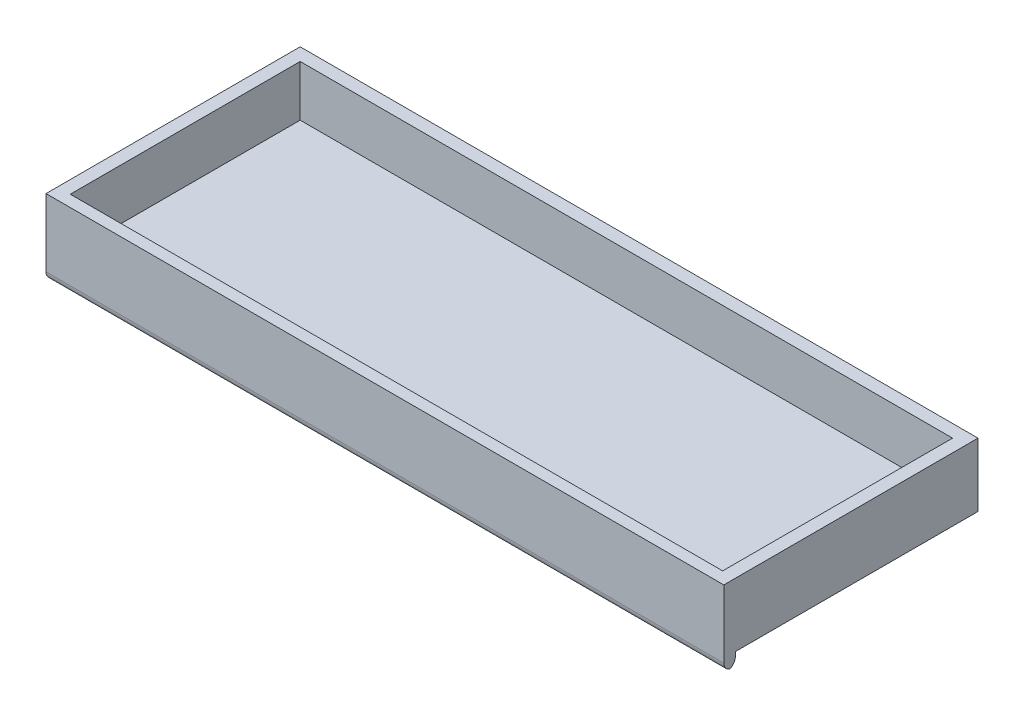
ISO-10303-21;
HEADER;
FILE_DESCRIPTION(('STEP AP214'),'2;1');
FILE_NAME('part.step','',(''),(''),'','','');
FILE_SCHEMA(('AUTOMOTIVE_DESIGN { 1 0 10303 214 1 1 1 1 }'));
ENDSEC;
DATA;
#1=APPLICATION_CONTEXT('core data for automotive mechanical design processes');
#2=APPLICATION_PROTOCOL_DEFINITION('international standard','automotive_design',2000,#1);
#3=PRODUCT_CONTEXT('',#1,'mechanical');
#4=PRODUCT('Part','Part','',(#3));
#5=PRODUCT_RELATED_PRODUCT_CATEGORY('part','',(#4));
#6=PRODUCT_DEFINITION_FORMATION('','',#4);
#7=PRODUCT_DEFINITION_CONTEXT('part definition',#1,'design');
#8=PRODUCT_DEFINITION('design','',#6,#7);
#9=PRODUCT_DEFINITION_SHAPE('','',#8);
#10=(LENGTH_UNIT() NAMED_UNIT(*) SI_UNIT(.MILLI.,.METRE.));
#11=(NAMED_UNIT(*) PLANE_ANGLE_UNIT() SI_UNIT($,.RADIAN.));
#12=(NAMED_UNIT(*) SI_UNIT($,.STERADIAN.) SOLID_ANGLE_UNIT());
#13=UNCERTAINTY_MEASURE_WITH_UNIT(LENGTH_MEASURE(1.E-05),#10,'distance_accuracy_value','');
#14=(GEOMETRIC_REPRESENTATION_CONTEXT(3) GLOBAL_UNCERTAINTY_ASSIGNED_CONTEXT((#13)) GLOBAL_UNIT_ASSIGNED_CONTEXT((#10,
#11,#12)) REPRESENTATION_CONTEXT('',''));
#15=CARTESIAN_POINT('',(0.,0.,0.));
#16=DIRECTION('',(0.,0.,1.));
#17=DIRECTION('',(1.,0.,0.));
#18=AXIS2_PLACEMENT_3D('',#15,#16,#17);
#19=CARTESIAN_POINT('',(0.,0.,0.));
#20=DIRECTION('',(0.,-1.,0.));
#21=DIRECTION('',(0.,0.,-1.));
#22=AXIS2_PLACEMENT_3D('',#19,#20,#21);
#23=PLANE('',#22);
#24=DIRECTION('',(0.,0.,-1.));
#25=VECTOR('',#24,1.);
#26=CARTESIAN_POINT('',(203.2,0.,76.2));
#27=LINE('',#26,#25);
#28=CARTESIAN_POINT('',(203.2,0.,69.2645488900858));
#29=VERTEX_POINT('',#28);
#30=CARTESIAN_POINT('',(203.2,0.,-76.2));
#31=VERTEX_POINT('',#30);
#32=EDGE_CURVE('E132',#29,#31,#27,.T.);
#33=ORIENTED_EDGE('',*,*,#32,.F.);
#34=DIRECTION('',(-1.,0.,0.));
#35=VECTOR('',#34,1.);
#36=CARTESIAN_POINT('',(0.,0.,69.2645488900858));
#37=LINE('',#36,#35);
#38=CARTESIAN_POINT('',(-203.2,0.,69.2645488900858));
#39=VERTEX_POINT('',#38);
#40=EDGE_CURVE('E116',#29,#39,#37,.T.);
#41=ORIENTED_EDGE('',*,*,#40,.T.);
#42=DIRECTION('',(0.,0.,1.));
#43=VECTOR('',#42,1.);
#44=CARTESIAN_POINT('',(-203.2,0.,76.2));
#45=LINE('',#44,#43);
#46=CARTESIAN_POINT('',(-203.2,0.,-76.2));
#47=VERTEX_POINT('',#46);
#48=EDGE_CURVE('E140',#47,#39,#45,.T.);
#49=ORIENTED_EDGE('',*,*,#48,.F.);
#50=DIRECTION('',(-1.,0.,0.));
#51=VECTOR('',#50,1.);
#52=CARTESIAN_POINT('',(-203.2,0.,-76.2));
#53=LINE('',#52,#51);
#54=EDGE_CURVE('E136',#31,#47,#53,.T.);
#55=ORIENTED_EDGE('',*,*,#54,.F.);
#56=EDGE_LOOP('',(#33,#41,#49,#55));
#57=FACE_BOUND('',#56,.T.);
#58=ADVANCED_FACE('F32',(#57),#23,.T.);
#59=CARTESIAN_POINT('',(203.2,38.1,76.2));
#60=DIRECTION('',(-1.,0.,0.));
#61=DIRECTION('',(0.,0.,1.));
#62=AXIS2_PLACEMENT_3D('',#59,#60,#61);
#63=PLANE('',#62);
#64=CARTESIAN_POINT('',(203.2,-2.53999999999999,71.12));
#65=DIRECTION('',(-1.,0.,0.));
#66=DIRECTION('',(0.,0.,1.));
#67=AXIS2_PLACEMENT_3D('',#64,#65,#66);
#68=CIRCLE('',#67,5.08);
#69=CARTESIAN_POINT('',(203.2,-2.53999999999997,76.2));
#70=VERTEX_POINT('',#69);
#71=CARTESIAN_POINT('',(203.2,-7.35736142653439,72.7322744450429));
#72=VERTEX_POINT('',#71);
#73=EDGE_CURVE('E48',#70,#72,#68,.F.);
#74=ORIENTED_EDGE('',*,*,#73,.T.);
#75=CARTESIAN_POINT('',(203.2,-2.53999999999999,74.3445488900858));
#76=DIRECTION('',(-1.,0.,0.));
#77=DIRECTION('',(0.,0.,1.));
#78=AXIS2_PLACEMENT_3D('',#75,#76,#77);
#79=CIRCLE('',#78,5.08);
#80=CARTESIAN_POINT('',(203.2,-2.53999999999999,69.2645488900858));
#81=VERTEX_POINT('',#80);
#82=EDGE_CURVE('E41',#72,#81,#79,.F.);
#83=ORIENTED_EDGE('',*,*,#82,.T.);
#84=DIRECTION('',(0.,-1.,0.));
#85=VECTOR('',#84,1.);
#86=CARTESIAN_POINT('',(203.2,38.1,69.2645488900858));
#87=LINE('',#86,#85);
#88=EDGE_CURVE('E120',#29,#81,#87,.T.);
#89=ORIENTED_EDGE('',*,*,#88,.F.);
#90=ORIENTED_EDGE('',*,*,#32,.T.);
#91=DIRECTION('',(0.,-1.,0.));
#92=VECTOR('',#91,1.);
#93=CARTESIAN_POINT('',(203.2,38.1,-76.2));
#94=LINE('',#93,#92);
#95=CARTESIAN_POINT('',(203.2,38.1,-76.2));
#96=VERTEX_POINT('',#95);
#97=EDGE_CURVE('E157',#96,#31,#94,.T.);
#98=ORIENTED_EDGE('',*,*,#97,.F.);
#99=DIRECTION('',(0.,0.,-1.));
#100=VECTOR('',#99,1.);
#101=CARTESIAN_POINT('',(203.2,38.1,76.2));
#102=LINE('',#101,#100);
#103=CARTESIAN_POINT('',(203.2,38.1,76.2));
#104=VERTEX_POINT('',#103);
#105=EDGE_CURVE('E149',#104,#96,#102,.T.);
#106=ORIENTED_EDGE('',*,*,#105,.F.);
#107=DIRECTION('',(0.,-1.,0.));
#108=VECTOR('',#107,1.);
#109=CARTESIAN_POINT('',(203.2,38.1,76.2));
#110=LINE('',#109,#108);
#111=EDGE_CURVE('E150',#104,#70,#110,.T.);
#112=ORIENTED_EDGE('',*,*,#111,.T.);
#113=EDGE_LOOP('',(#74,#83,#89,#90,#98,#106,#112));
#114=FACE_BOUND('',#113,.T.);
#115=ADVANCED_FACE('F130',(#114),#63,.F.);
#116=CARTESIAN_POINT('',(-203.2,38.1,-76.2));
#117=DIRECTION('',(0.,0.,1.));
#118=DIRECTION('',(1.,0.,0.));
#119=AXIS2_PLACEMENT_3D('',#116,#117,#118);
#120=PLANE('',#119);
#121=ORIENTED_EDGE('',*,*,#54,.T.);
#122=DIRECTION('',(0.,-1.,0.));
#123=VECTOR('',#122,1.);
#124=CARTESIAN_POINT('',(-203.2,38.1,-76.2));
#125=LINE('',#124,#123);
#126=CARTESIAN_POINT('',(-203.2,38.1,-76.2));
#127=VERTEX_POINT('',#126);
#128=EDGE_CURVE('E154',#127,#47,#125,.T.);
#129=ORIENTED_EDGE('',*,*,#128,.F.);
#130=DIRECTION('',(-1.,0.,0.));
#131=VECTOR('',#130,1.);
#132=CARTESIAN_POINT('',(-203.2,38.1,-76.2));
#133=LINE('',#132,#131);
#134=EDGE_CURVE('E204',#96,#127,#133,.T.);
#135=ORIENTED_EDGE('',*,*,#134,.F.);
#136=ORIENTED_EDGE('',*,*,#97,.T.);
#137=EDGE_LOOP('',(#121,#129,#135,#136));
#138=FACE_BOUND('',#137,.T.);
#139=ADVANCED_FACE('F184',(#138),#120,.F.);
#140=CARTESIAN_POINT('',(-203.2,38.1,76.2));
#141=DIRECTION('',(1.,0.,0.));
#142=DIRECTION('',(0.,0.,-1.));
#143=AXIS2_PLACEMENT_3D('',#140,#141,#142);
#144=PLANE('',#143);
#145=DIRECTION('',(0.,1.,0.));
#146=VECTOR('',#145,1.);
#147=CARTESIAN_POINT('',(-203.2,38.1,69.2645488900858));
#148=LINE('',#147,#146);
#149=CARTESIAN_POINT('',(-203.2,-2.53999999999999,69.2645488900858));
#150=VERTEX_POINT('',#149);
#151=EDGE_CURVE('E123',#150,#39,#148,.T.);
#152=ORIENTED_EDGE('',*,*,#151,.F.);
#153=CARTESIAN_POINT('',(-203.2,-2.53999999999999,74.3445488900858));
#154=DIRECTION('',(1.,0.,0.));
#155=DIRECTION('',(0.,0.,-1.));
#156=AXIS2_PLACEMENT_3D('',#153,#154,#155);
#157=CIRCLE('',#156,5.08);
#158=CARTESIAN_POINT('',(-203.2,-7.35736142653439,72.7322744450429));
#159=VERTEX_POINT('',#158);
#160=EDGE_CURVE('E163',#150,#159,#157,.F.);
#161=ORIENTED_EDGE('',*,*,#160,.T.);
#162=CARTESIAN_POINT('',(-203.2,-2.53999999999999,71.12));
#163=DIRECTION('',(1.,0.,0.));
#164=DIRECTION('',(0.,0.,-1.));
#165=AXIS2_PLACEMENT_3D('',#162,#163,#164);
#166=CIRCLE('',#165,5.08);
#167=CARTESIAN_POINT('',(-203.2,-2.53999999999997,76.2));
#168=VERTEX_POINT('',#167);
#169=EDGE_CURVE('E161',#159,#168,#166,.F.);
#170=ORIENTED_EDGE('',*,*,#169,.T.);
#171=DIRECTION('',(0.,-1.,0.));
#172=VECTOR('',#171,1.);
#173=CARTESIAN_POINT('',(-203.2,38.1,76.2));
#174=LINE('',#173,#172);
#175=CARTESIAN_POINT('',(-203.2,38.1,76.2));
#176=VERTEX_POINT('',#175);
#177=EDGE_CURVE('E152',#176,#168,#174,.T.);
#178=ORIENTED_EDGE('',*,*,#177,.F.);
#179=DIRECTION('',(0.,0.,1.));
#180=VECTOR('',#179,1.);
#181=CARTESIAN_POINT('',(-203.2,38.1,76.2));
#182=LINE('',#181,#180);
#183=EDGE_CURVE('E201',#127,#176,#182,.T.);
#184=ORIENTED_EDGE('',*,*,#183,.F.);
#185=ORIENTED_EDGE('',*,*,#128,.T.);
#186=ORIENTED_EDGE('',*,*,#48,.T.);
#187=EDGE_LOOP('',(#152,#161,#170,#178,#184,#185,#186));
#188=FACE_BOUND('',#187,.T.);
#189=ADVANCED_FACE('F168',(#188),#144,.F.);
#190=CARTESIAN_POINT('',(-203.2,38.1,76.2));
#191=DIRECTION('',(0.,0.,-1.));
#192=DIRECTION('',(-1.,0.,0.));
#193=AXIS2_PLACEMENT_3D('',#190,#191,#192);
#194=PLANE('',#193);
#195=ORIENTED_EDGE('',*,*,#177,.T.);
#196=DIRECTION('',(1.,0.,0.));
#197=VECTOR('',#196,1.);
#198=CARTESIAN_POINT('',(203.2,-2.53999999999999,76.2));
#199=LINE('',#198,#197);
#200=EDGE_CURVE('E11',#168,#70,#199,.T.);
#201=ORIENTED_EDGE('',*,*,#200,.T.);
#202=ORIENTED_EDGE('',*,*,#111,.F.);
#203=DIRECTION('',(1.,0.,0.));
#204=VECTOR('',#203,1.);
#205=CARTESIAN_POINT('',(-203.2,38.1,76.2));
#206=LINE('',#205,#204);
#207=EDGE_CURVE('E145',#176,#104,#206,.T.);
#208=ORIENTED_EDGE('',*,*,#207,.F.);
#209=EDGE_LOOP('',(#195,#201,#202,#208));
#210=FACE_BOUND('',#209,.T.);
#211=ADVANCED_FACE('F189',(#210),#194,.F.);
#212=CARTESIAN_POINT('',(0.,38.1,0.));
#213=DIRECTION('',(0.,-1.,0.));
#214=DIRECTION('',(0.,0.,-1.));
#215=AXIS2_PLACEMENT_3D('',#212,#213,#214);
#216=PLANE('',#215);
#217=DIRECTION('',(0.,0.,-1.));
#218=VECTOR('',#217,1.);
#219=CARTESIAN_POINT('',(195.58,38.1,-68.58));
#220=LINE('',#219,#218);
#221=CARTESIAN_POINT('',(195.58,38.1,69.2645488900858));
#222=VERTEX_POINT('',#221);
#223=CARTESIAN_POINT('',(195.58,38.1,-68.58));
#224=VERTEX_POINT('',#223);
#225=EDGE_CURVE('E219',#222,#224,#220,.T.);
#226=ORIENTED_EDGE('',*,*,#225,.F.);
#227=DIRECTION('',(1.,0.,0.));
#228=VECTOR('',#227,1.);
#229=CARTESIAN_POINT('',(-195.58,38.1,69.2645488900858));
#230=LINE('',#229,#228);
#231=CARTESIAN_POINT('',(-195.58,38.1,69.2645488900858));
#232=VERTEX_POINT('',#231);
#233=EDGE_CURVE('E222',#232,#222,#230,.T.);
#234=ORIENTED_EDGE('',*,*,#233,.F.);
#235=DIRECTION('',(0.,0.,1.));
#236=VECTOR('',#235,1.);
#237=CARTESIAN_POINT('',(-195.58,38.1,-68.58));
#238=LINE('',#237,#236);
#239=CARTESIAN_POINT('',(-195.58,38.1,-68.58));
#240=VERTEX_POINT('',#239);
#241=EDGE_CURVE('E128',#240,#232,#238,.T.);
#242=ORIENTED_EDGE('',*,*,#241,.F.);
#243=DIRECTION('',(-1.,0.,0.));
#244=VECTOR('',#243,1.);
#245=CARTESIAN_POINT('',(-195.58,38.1,-68.58));
#246=LINE('',#245,#244);
#247=EDGE_CURVE('E215',#224,#240,#246,.T.);
#248=ORIENTED_EDGE('',*,*,#247,.F.);
#249=EDGE_LOOP('',(#226,#234,#242,#248));
#250=FACE_BOUND('',#249,.T.);
#251=ORIENTED_EDGE('',*,*,#105,.T.);
#252=ORIENTED_EDGE('',*,*,#134,.T.);
#253=ORIENTED_EDGE('',*,*,#183,.T.);
#254=ORIENTED_EDGE('',*,*,#207,.T.);
#255=EDGE_LOOP('',(#251,#252,#253,#254));
#256=FACE_BOUND('',#255,.T.);
#257=ADVANCED_FACE('F187',(#250,#256),#216,.F.);
#258=CARTESIAN_POINT('',(-195.58,7.62000000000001,-68.58));
#259=DIRECTION('',(-1.,0.,0.));
#260=DIRECTION('',(0.,0.,1.));
#261=AXIS2_PLACEMENT_3D('',#258,#259,#260);
#262=PLANE('',#261);
#263=ORIENTED_EDGE('',*,*,#241,.T.);
#264=DIRECTION('',(0.,1.,0.));
#265=VECTOR('',#264,1.);
#266=CARTESIAN_POINT('',(-195.58,7.62000000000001,69.2645488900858));
#267=LINE('',#266,#265);
#268=CARTESIAN_POINT('',(-195.58,7.62000000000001,69.2645488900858));
#269=VERTEX_POINT('',#268);
#270=EDGE_CURVE('E208',#269,#232,#267,.T.);
#271=ORIENTED_EDGE('',*,*,#270,.F.);
#272=DIRECTION('',(0.,0.,1.));
#273=VECTOR('',#272,1.);
#274=CARTESIAN_POINT('',(-195.58,7.62000000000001,-68.58));
#275=LINE('',#274,#273);
#276=CARTESIAN_POINT('',(-195.58,7.62000000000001,-68.58));
#277=VERTEX_POINT('',#276);
#278=EDGE_CURVE('E218',#277,#269,#275,.T.);
#279=ORIENTED_EDGE('',*,*,#278,.F.);
#280=DIRECTION('',(0.,1.,0.));
#281=VECTOR('',#280,1.);
#282=CARTESIAN_POINT('',(-195.58,7.62000000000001,-68.58));
#283=LINE('',#282,#281);
#284=EDGE_CURVE('E138',#277,#240,#283,.T.);
#285=ORIENTED_EDGE('',*,*,#284,.T.);
#286=EDGE_LOOP('',(#263,#271,#279,#285));
#287=FACE_BOUND('',#286,.T.);
#288=ADVANCED_FACE('F242',(#287),#262,.F.);
#289=CARTESIAN_POINT('',(-195.58,7.62000000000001,-68.58));
#290=DIRECTION('',(0.,0.,-1.));
#291=DIRECTION('',(-1.,0.,0.));
#292=AXIS2_PLACEMENT_3D('',#289,#290,#291);
#293=PLANE('',#292);
#294=ORIENTED_EDGE('',*,*,#247,.T.);
#295=ORIENTED_EDGE('',*,*,#284,.F.);
#296=DIRECTION('',(-1.,0.,0.));
#297=VECTOR('',#296,1.);
#298=CARTESIAN_POINT('',(-195.58,7.62000000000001,-68.58));
#299=LINE('',#298,#297);
#300=CARTESIAN_POINT('',(195.58,7.62000000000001,-68.58));
#301=VERTEX_POINT('',#300);
#302=EDGE_CURVE('E212',#301,#277,#299,.T.);
#303=ORIENTED_EDGE('',*,*,#302,.F.);
#304=DIRECTION('',(0.,1.,0.));
#305=VECTOR('',#304,1.);
#306=CARTESIAN_POINT('',(195.58,7.62000000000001,-68.58));
#307=LINE('',#306,#305);
#308=EDGE_CURVE('E142',#301,#224,#307,.T.);
#309=ORIENTED_EDGE('',*,*,#308,.T.);
#310=EDGE_LOOP('',(#294,#295,#303,#309));
#311=FACE_BOUND('',#310,.T.);
#312=ADVANCED_FACE('F252',(#311),#293,.F.);
#313=CARTESIAN_POINT('',(195.58,7.62000000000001,-68.58));
#314=DIRECTION('',(1.,0.,0.));
#315=DIRECTION('',(0.,0.,-1.));
#316=AXIS2_PLACEMENT_3D('',#313,#314,#315);
#317=PLANE('',#316);
#318=ORIENTED_EDGE('',*,*,#225,.T.);
#319=ORIENTED_EDGE('',*,*,#308,.F.);
#320=DIRECTION('',(0.,0.,-1.));
#321=VECTOR('',#320,1.);
#322=CARTESIAN_POINT('',(195.58,7.62000000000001,-68.58));
#323=LINE('',#322,#321);
#324=CARTESIAN_POINT('',(195.58,7.62000000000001,69.2645488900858));
#325=VERTEX_POINT('',#324);
#326=EDGE_CURVE('E228',#325,#301,#323,.T.);
#327=ORIENTED_EDGE('',*,*,#326,.F.);
#328=DIRECTION('',(0.,1.,0.));
#329=VECTOR('',#328,1.);
#330=CARTESIAN_POINT('',(195.58,7.62000000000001,69.2645488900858));
#331=LINE('',#330,#329);
#332=EDGE_CURVE('E211',#325,#222,#331,.T.);
#333=ORIENTED_EDGE('',*,*,#332,.T.);
#334=EDGE_LOOP('',(#318,#319,#327,#333));
#335=FACE_BOUND('',#334,.T.);
#336=ADVANCED_FACE('F250',(#335),#317,.F.);
#337=CARTESIAN_POINT('',(-195.58,7.62000000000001,69.2645488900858));
#338=DIRECTION('',(0.,0.,1.));
#339=DIRECTION('',(1.,0.,0.));
#340=AXIS2_PLACEMENT_3D('',#337,#338,#339);
#341=PLANE('',#340);
#342=ORIENTED_EDGE('',*,*,#233,.T.);
#343=ORIENTED_EDGE('',*,*,#332,.F.);
#344=DIRECTION('',(1.,0.,0.));
#345=VECTOR('',#344,1.);
#346=CARTESIAN_POINT('',(-195.58,7.62000000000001,69.2645488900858));
#347=LINE('',#346,#345);
#348=EDGE_CURVE('E231',#269,#325,#347,.T.);
#349=ORIENTED_EDGE('',*,*,#348,.F.);
#350=ORIENTED_EDGE('',*,*,#270,.T.);
#351=EDGE_LOOP('',(#342,#343,#349,#350));
#352=FACE_BOUND('',#351,.T.);
#353=ADVANCED_FACE('F246',(#352),#341,.F.);
#354=CARTESIAN_POINT('',(0.,7.62000000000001,0.));
#355=DIRECTION('',(0.,1.,0.));
#356=DIRECTION('',(0.,0.,1.));
#357=AXIS2_PLACEMENT_3D('',#354,#355,#356);
#358=PLANE('',#357);
#359=ORIENTED_EDGE('',*,*,#278,.T.);
#360=ORIENTED_EDGE('',*,*,#348,.T.);
#361=ORIENTED_EDGE('',*,*,#326,.T.);
#362=ORIENTED_EDGE('',*,*,#302,.T.);
#363=EDGE_LOOP('',(#359,#360,#361,#362));
#364=FACE_BOUND('',#363,.T.);
#365=ADVANCED_FACE('F238',(#364),#358,.T.);
#366=CARTESIAN_POINT('',(-195.58,7.62000000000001,69.2645488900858));
#367=DIRECTION('',(0.,0.,1.));
#368=DIRECTION('',(1.,0.,0.));
#369=AXIS2_PLACEMENT_3D('',#366,#367,#368);
#370=PLANE('',#369);
#371=ORIENTED_EDGE('',*,*,#88,.T.);
#372=DIRECTION('',(-1.,0.,0.));
#373=VECTOR('',#372,1.);
#374=CARTESIAN_POINT('',(-203.2,-2.53999999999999,69.2645488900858));
#375=LINE('',#374,#373);
#376=EDGE_CURVE('E159',#81,#150,#375,.T.);
#377=ORIENTED_EDGE('',*,*,#376,.T.);
#378=ORIENTED_EDGE('',*,*,#151,.T.);
#379=ORIENTED_EDGE('',*,*,#40,.F.);
#380=EDGE_LOOP('',(#371,#377,#378,#379));
#381=FACE_BOUND('',#380,.T.);
#382=ADVANCED_FACE('F118',(#381),#370,.F.);
#383=CARTESIAN_POINT('',(-203.2,-2.53999999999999,71.12));
#384=DIRECTION('',(-1.,0.,0.));
#385=DIRECTION('',(0.,0.,1.));
#386=AXIS2_PLACEMENT_3D('',#383,#384,#385);
#387=CYLINDRICAL_SURFACE('',#386,5.08);
#388=DIRECTION('',(-1.,0.,0.));
#389=VECTOR('',#388,1.);
#390=CARTESIAN_POINT('',(0.,-7.3573614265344,72.7322744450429));
#391=LINE('',#390,#389);
#392=EDGE_CURVE('E36',#72,#159,#391,.T.);
#393=ORIENTED_EDGE('',*,*,#392,.F.);
#394=ORIENTED_EDGE('',*,*,#73,.F.);
#395=ORIENTED_EDGE('',*,*,#200,.F.);
#396=ORIENTED_EDGE('',*,*,#169,.F.);
#397=EDGE_LOOP('',(#393,#394,#395,#396));
#398=FACE_BOUND('',#397,.T.);
#399=ADVANCED_FACE('F34',(#398),#387,.T.);
#400=CARTESIAN_POINT('',(-195.58,-2.53999999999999,74.3445488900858));
#401=DIRECTION('',(1.,0.,0.));
#402=DIRECTION('',(0.,0.,-1.));
#403=AXIS2_PLACEMENT_3D('',#400,#401,#402);
#404=CYLINDRICAL_SURFACE('',#403,5.08);
#405=ORIENTED_EDGE('',*,*,#82,.F.);
#406=ORIENTED_EDGE('',*,*,#392,.T.);
#407=ORIENTED_EDGE('',*,*,#160,.F.);
#408=ORIENTED_EDGE('',*,*,#376,.F.);
#409=EDGE_LOOP('',(#405,#406,#407,#408));
#410=FACE_BOUND('',#409,.T.);
#411=ADVANCED_FACE('F173',(#410),#404,.T.);
#412=CLOSED_SHELL('',(#58,#115,#139,#189,#211,#257,#288,#312,#336,#353,#365,#382,#399,#411));
#413=MANIFOLD_SOLID_BREP('B2',#412);
#414=ADVANCED_BREP_SHAPE_REPRESENTATION('',(#18,#413),#14);
#415=SHAPE_DEFINITION_REPRESENTATION(#9,#414);
ENDSEC;
END-ISO-10303-21;
